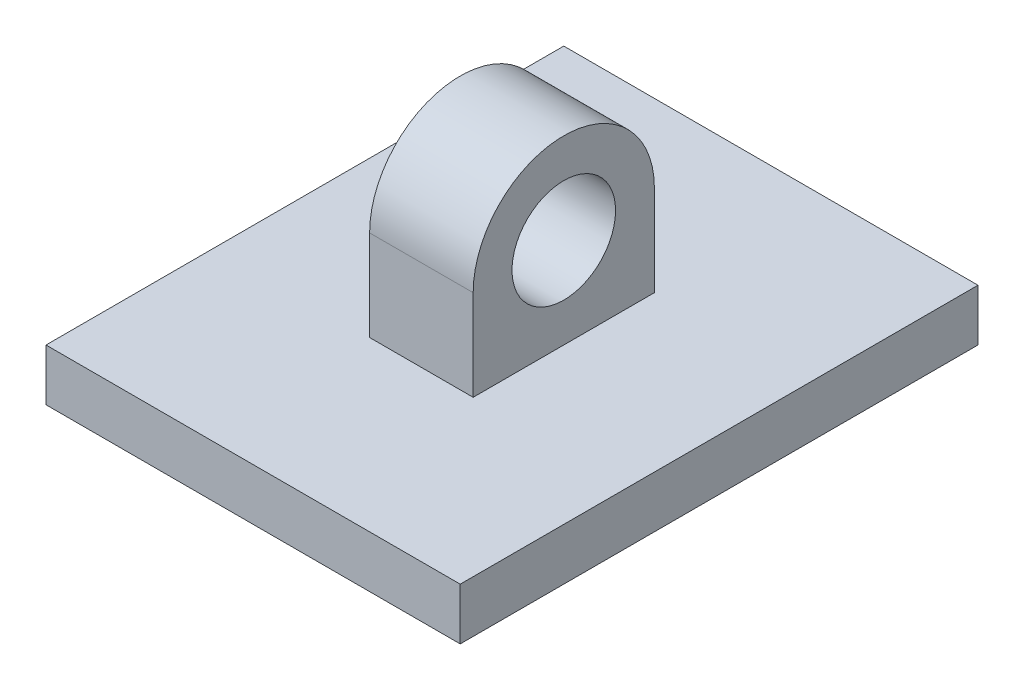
ISO-10303-21;
HEADER;
FILE_DESCRIPTION(('STEP AP214'),'2;1');
FILE_NAME('part.step','',(''),(''),'','','');
FILE_SCHEMA(('AUTOMOTIVE_DESIGN { 1 0 10303 214 1 1 1 1 }'));
ENDSEC;
DATA;
#1=APPLICATION_CONTEXT('core data for automotive mechanical design processes');
#2=APPLICATION_PROTOCOL_DEFINITION('international standard','automotive_design',2000,#1);
#3=PRODUCT_CONTEXT('',#1,'mechanical');
#4=PRODUCT('Part','Part','',(#3));
#5=PRODUCT_RELATED_PRODUCT_CATEGORY('part','',(#4));
#6=PRODUCT_DEFINITION_FORMATION('','',#4);
#7=PRODUCT_DEFINITION_CONTEXT('part definition',#1,'design');
#8=PRODUCT_DEFINITION('design','',#6,#7);
#9=PRODUCT_DEFINITION_SHAPE('','',#8);
#10=(LENGTH_UNIT() NAMED_UNIT(*) SI_UNIT(.MILLI.,.METRE.));
#11=(NAMED_UNIT(*) PLANE_ANGLE_UNIT() SI_UNIT($,.RADIAN.));
#12=(NAMED_UNIT(*) SI_UNIT($,.STERADIAN.) SOLID_ANGLE_UNIT());
#13=UNCERTAINTY_MEASURE_WITH_UNIT(LENGTH_MEASURE(1.E-05),#10,'distance_accuracy_value','');
#14=(GEOMETRIC_REPRESENTATION_CONTEXT(3) GLOBAL_UNCERTAINTY_ASSIGNED_CONTEXT((#13)) GLOBAL_UNIT_ASSIGNED_CONTEXT((#10,
#11,#12)) REPRESENTATION_CONTEXT('',''));
#15=CARTESIAN_POINT('',(0.,0.,0.));
#16=DIRECTION('',(0.,0.,1.));
#17=DIRECTION('',(1.,0.,0.));
#18=AXIS2_PLACEMENT_3D('',#15,#16,#17);
#19=CARTESIAN_POINT('',(50.,0.,-87.5));
#20=DIRECTION('',(0.,0.,-1.));
#21=DIRECTION('',(0.,1.,0.));
#22=AXIS2_PLACEMENT_3D('',#19,#20,#21);
#23=PLANE('',#22);
#24=DIRECTION('',(0.,-1.,0.));
#25=VECTOR('',#24,1.);
#26=CARTESIAN_POINT('',(-50.,0.,-87.5));
#27=LINE('',#26,#25);
#28=CARTESIAN_POINT('',(-50.,0.,-87.5));
#29=VERTEX_POINT('',#28);
#30=CARTESIAN_POINT('',(-50.,-87.5,-87.5));
#31=VERTEX_POINT('',#30);
#32=EDGE_CURVE('E168',#29,#31,#27,.T.);
#33=ORIENTED_EDGE('',*,*,#32,.F.);
#34=DIRECTION('',(-1.,0.,0.));
#35=VECTOR('',#34,1.);
#36=CARTESIAN_POINT('',(50.,0.,-87.5));
#37=LINE('',#36,#35);
#38=CARTESIAN_POINT('',(50.,0.,-87.5));
#39=VERTEX_POINT('',#38);
#40=EDGE_CURVE('E11',#39,#29,#37,.T.);
#41=ORIENTED_EDGE('',*,*,#40,.F.);
#42=DIRECTION('',(0.,-1.,0.));
#43=VECTOR('',#42,1.);
#44=CARTESIAN_POINT('',(50.,0.,-87.5));
#45=LINE('',#44,#43);
#46=CARTESIAN_POINT('',(50.,-87.5,-87.5));
#47=VERTEX_POINT('',#46);
#48=EDGE_CURVE('E157',#39,#47,#45,.T.);
#49=ORIENTED_EDGE('',*,*,#48,.T.);
#50=DIRECTION('',(-1.,0.,0.));
#51=VECTOR('',#50,1.);
#52=CARTESIAN_POINT('',(50.,-87.5,-87.5));
#53=LINE('',#52,#51);
#54=EDGE_CURVE('E77',#47,#31,#53,.T.);
#55=ORIENTED_EDGE('',*,*,#54,.T.);
#56=EDGE_LOOP('',(#33,#41,#49,#55));
#57=FACE_BOUND('',#56,.T.);
#58=ADVANCED_FACE('F39',(#57),#23,.T.);
#59=CARTESIAN_POINT('',(50.,0.,0.));
#60=DIRECTION('',(-1.,0.,0.));
#61=DIRECTION('',(0.,0.,1.));
#62=AXIS2_PLACEMENT_3D('',#59,#60,#61);
#63=CYLINDRICAL_SURFACE('',#62,87.5);
#64=CARTESIAN_POINT('',(-50.,0.,0.));
#65=DIRECTION('',(1.,0.,0.));
#66=DIRECTION('',(0.,0.,-1.));
#67=AXIS2_PLACEMENT_3D('',#64,#65,#66);
#68=CIRCLE('',#67,87.5);
#69=CARTESIAN_POINT('',(-50.,0.,87.5));
#70=VERTEX_POINT('',#69);
#71=EDGE_CURVE('E170',#29,#70,#68,.T.);
#72=ORIENTED_EDGE('',*,*,#71,.T.);
#73=DIRECTION('',(-1.,0.,0.));
#74=VECTOR('',#73,1.);
#75=CARTESIAN_POINT('',(50.,0.,87.5));
#76=LINE('',#75,#74);
#77=CARTESIAN_POINT('',(50.,0.,87.5));
#78=VERTEX_POINT('',#77);
#79=EDGE_CURVE('E48',#78,#70,#76,.T.);
#80=ORIENTED_EDGE('',*,*,#79,.F.);
#81=CARTESIAN_POINT('',(50.,0.,0.));
#82=DIRECTION('',(1.,0.,0.));
#83=DIRECTION('',(0.,0.,-1.));
#84=AXIS2_PLACEMENT_3D('',#81,#82,#83);
#85=CIRCLE('',#84,87.5);
#86=EDGE_CURVE('E160',#39,#78,#85,.T.);
#87=ORIENTED_EDGE('',*,*,#86,.F.);
#88=ORIENTED_EDGE('',*,*,#40,.T.);
#89=EDGE_LOOP('',(#72,#80,#87,#88));
#90=FACE_BOUND('',#89,.T.);
#91=ADVANCED_FACE('F184',(#90),#63,.T.);
#92=CARTESIAN_POINT('',(50.,0.,87.5));
#93=DIRECTION('',(0.,0.,-1.));
#94=DIRECTION('',(0.,1.,0.));
#95=AXIS2_PLACEMENT_3D('',#92,#93,#94);
#96=PLANE('',#95);
#97=DIRECTION('',(0.,-1.,0.));
#98=VECTOR('',#97,1.);
#99=CARTESIAN_POINT('',(-50.,0.,87.5));
#100=LINE('',#99,#98);
#101=CARTESIAN_POINT('',(-50.,-87.5,87.5));
#102=VERTEX_POINT('',#101);
#103=EDGE_CURVE('E70',#70,#102,#100,.T.);
#104=ORIENTED_EDGE('',*,*,#103,.T.);
#105=DIRECTION('',(-1.,0.,0.));
#106=VECTOR('',#105,1.);
#107=CARTESIAN_POINT('',(50.,-87.5,87.5));
#108=LINE('',#107,#106);
#109=CARTESIAN_POINT('',(50.,-87.5,87.5));
#110=VERTEX_POINT('',#109);
#111=EDGE_CURVE('E177',#110,#102,#108,.T.);
#112=ORIENTED_EDGE('',*,*,#111,.F.);
#113=DIRECTION('',(0.,-1.,0.));
#114=VECTOR('',#113,1.);
#115=CARTESIAN_POINT('',(50.,0.,87.5));
#116=LINE('',#115,#114);
#117=EDGE_CURVE('E163',#78,#110,#116,.T.);
#118=ORIENTED_EDGE('',*,*,#117,.F.);
#119=ORIENTED_EDGE('',*,*,#79,.T.);
#120=EDGE_LOOP('',(#104,#112,#118,#119));
#121=FACE_BOUND('',#120,.T.);
#122=ADVANCED_FACE('F181',(#121),#96,.F.);
#123=CARTESIAN_POINT('',(50.,0.,0.));
#124=DIRECTION('',(-1.,0.,0.));
#125=DIRECTION('',(0.,0.,1.));
#126=AXIS2_PLACEMENT_3D('',#123,#124,#125);
#127=CYLINDRICAL_SURFACE('',#126,50.);
#128=CARTESIAN_POINT('',(50.,0.,0.));
#129=DIRECTION('',(1.,0.,0.));
#130=DIRECTION('',(0.,0.,-1.));
#131=AXIS2_PLACEMENT_3D('',#128,#129,#130);
#132=CIRCLE('',#131,50.);
#133=CARTESIAN_POINT('',(50.,0.,-50.));
#134=VERTEX_POINT('',#133);
#135=EDGE_CURVE('E154',#134,#134,#132,.T.);
#136=ORIENTED_EDGE('',*,*,#135,.T.);
#137=EDGE_LOOP('',(#136));
#138=FACE_BOUND('',#137,.T.);
#139=CARTESIAN_POINT('',(-50.,0.,0.));
#140=DIRECTION('',(1.,0.,0.));
#141=DIRECTION('',(0.,0.,-1.));
#142=AXIS2_PLACEMENT_3D('',#139,#140,#141);
#143=CIRCLE('',#142,50.);
#144=CARTESIAN_POINT('',(-50.,0.,-50.));
#145=VERTEX_POINT('',#144);
#146=EDGE_CURVE('E122',#145,#145,#143,.T.);
#147=ORIENTED_EDGE('',*,*,#146,.F.);
#148=EDGE_LOOP('',(#147));
#149=FACE_BOUND('',#148,.T.);
#150=ADVANCED_FACE('F41',(#138,#149),#127,.F.);
#151=CARTESIAN_POINT('',(50.,0.,0.));
#152=DIRECTION('',(1.,0.,0.));
#153=DIRECTION('',(0.,0.,-1.));
#154=AXIS2_PLACEMENT_3D('',#151,#152,#153);
#155=PLANE('',#154);
#156=ORIENTED_EDGE('',*,*,#135,.F.);
#157=EDGE_LOOP('',(#156));
#158=FACE_BOUND('',#157,.T.);
#159=ORIENTED_EDGE('',*,*,#48,.F.);
#160=ORIENTED_EDGE('',*,*,#86,.T.);
#161=ORIENTED_EDGE('',*,*,#117,.T.);
#162=DIRECTION('',(0.,0.,-1.));
#163=VECTOR('',#162,1.);
#164=CARTESIAN_POINT('',(50.,-87.5,0.));
#165=LINE('',#164,#163);
#166=EDGE_CURVE('E56',#110,#47,#165,.T.);
#167=ORIENTED_EDGE('',*,*,#166,.T.);
#168=EDGE_LOOP('',(#159,#160,#161,#167));
#169=FACE_BOUND('',#168,.T.);
#170=ADVANCED_FACE('F196',(#158,#169),#155,.T.);
#171=CARTESIAN_POINT('',(-50.,0.,0.));
#172=DIRECTION('',(1.,0.,0.));
#173=DIRECTION('',(0.,0.,-1.));
#174=AXIS2_PLACEMENT_3D('',#171,#172,#173);
#175=PLANE('',#174);
#176=ORIENTED_EDGE('',*,*,#146,.T.);
#177=EDGE_LOOP('',(#176));
#178=FACE_BOUND('',#177,.T.);
#179=ORIENTED_EDGE('',*,*,#32,.T.);
#180=DIRECTION('',(0.,0.,-1.));
#181=VECTOR('',#180,1.);
#182=CARTESIAN_POINT('',(-50.,-87.5,0.));
#183=LINE('',#182,#181);
#184=EDGE_CURVE('E158',#102,#31,#183,.T.);
#185=ORIENTED_EDGE('',*,*,#184,.F.);
#186=ORIENTED_EDGE('',*,*,#103,.F.);
#187=ORIENTED_EDGE('',*,*,#71,.F.);
#188=EDGE_LOOP('',(#179,#185,#186,#187));
#189=FACE_BOUND('',#188,.T.);
#190=ADVANCED_FACE('F185',(#178,#189),#175,.F.);
#191=CARTESIAN_POINT('',(200.,-87.5,0.));
#192=DIRECTION('',(0.,1.,0.));
#193=DIRECTION('',(0.,0.,1.));
#194=AXIS2_PLACEMENT_3D('',#191,#192,#193);
#195=PLANE('',#194);
#196=ORIENTED_EDGE('',*,*,#111,.T.);
#197=ORIENTED_EDGE('',*,*,#184,.T.);
#198=ORIENTED_EDGE('',*,*,#54,.F.);
#199=ORIENTED_EDGE('',*,*,#166,.F.);
#200=EDGE_LOOP('',(#196,#197,#198,#199));
#201=FACE_BOUND('',#200,.T.);
#202=DIRECTION('',(0.,0.,-1.));
#203=VECTOR('',#202,1.);
#204=CARTESIAN_POINT('',(-200.,-87.5,0.));
#205=LINE('',#204,#203);
#206=CARTESIAN_POINT('',(-200.,-87.5,250.));
#207=VERTEX_POINT('',#206);
#208=CARTESIAN_POINT('',(-200.,-87.5,-250.));
#209=VERTEX_POINT('',#208);
#210=EDGE_CURVE('E117',#207,#209,#205,.T.);
#211=ORIENTED_EDGE('',*,*,#210,.F.);
#212=DIRECTION('',(-1.,0.,0.));
#213=VECTOR('',#212,1.);
#214=CARTESIAN_POINT('',(200.,-87.5,250.));
#215=LINE('',#214,#213);
#216=CARTESIAN_POINT('',(200.,-87.5,250.));
#217=VERTEX_POINT('',#216);
#218=EDGE_CURVE('E111',#217,#207,#215,.T.);
#219=ORIENTED_EDGE('',*,*,#218,.F.);
#220=DIRECTION('',(0.,0.,-1.));
#221=VECTOR('',#220,1.);
#222=CARTESIAN_POINT('',(200.,-87.5,0.));
#223=LINE('',#222,#221);
#224=CARTESIAN_POINT('',(200.,-87.5,-250.));
#225=VERTEX_POINT('',#224);
#226=EDGE_CURVE('E114',#217,#225,#223,.T.);
#227=ORIENTED_EDGE('',*,*,#226,.T.);
#228=DIRECTION('',(-1.,0.,0.));
#229=VECTOR('',#228,1.);
#230=CARTESIAN_POINT('',(200.,-87.5,-250.));
#231=LINE('',#230,#229);
#232=EDGE_CURVE('E141',#225,#209,#231,.T.);
#233=ORIENTED_EDGE('',*,*,#232,.T.);
#234=EDGE_LOOP('',(#211,#219,#227,#233));
#235=FACE_BOUND('',#234,.T.);
#236=ADVANCED_FACE('F113',(#201,#235),#195,.T.);
#237=CARTESIAN_POINT('',(200.,0.,250.));
#238=DIRECTION('',(0.,0.,1.));
#239=DIRECTION('',(1.,0.,0.));
#240=AXIS2_PLACEMENT_3D('',#237,#238,#239);
#241=PLANE('',#240);
#242=DIRECTION('',(0.,1.,0.));
#243=VECTOR('',#242,1.);
#244=CARTESIAN_POINT('',(-200.,0.,250.));
#245=LINE('',#244,#243);
#246=CARTESIAN_POINT('',(-200.,-137.5,250.));
#247=VERTEX_POINT('',#246);
#248=EDGE_CURVE('E143',#247,#207,#245,.T.);
#249=ORIENTED_EDGE('',*,*,#248,.F.);
#250=DIRECTION('',(-1.,0.,0.));
#251=VECTOR('',#250,1.);
#252=CARTESIAN_POINT('',(200.,-137.5,250.));
#253=LINE('',#252,#251);
#254=CARTESIAN_POINT('',(200.,-137.5,250.));
#255=VERTEX_POINT('',#254);
#256=EDGE_CURVE('E123',#255,#247,#253,.T.);
#257=ORIENTED_EDGE('',*,*,#256,.F.);
#258=DIRECTION('',(0.,1.,0.));
#259=VECTOR('',#258,1.);
#260=CARTESIAN_POINT('',(200.,0.,250.));
#261=LINE('',#260,#259);
#262=EDGE_CURVE('E129',#255,#217,#261,.T.);
#263=ORIENTED_EDGE('',*,*,#262,.T.);
#264=ORIENTED_EDGE('',*,*,#218,.T.);
#265=EDGE_LOOP('',(#249,#257,#263,#264));
#266=FACE_BOUND('',#265,.T.);
#267=ADVANCED_FACE('F135',(#266),#241,.T.);
#268=CARTESIAN_POINT('',(200.,-137.5,0.));
#269=DIRECTION('',(0.,-1.,0.));
#270=DIRECTION('',(0.,0.,-1.));
#271=AXIS2_PLACEMENT_3D('',#268,#269,#270);
#272=PLANE('',#271);
#273=DIRECTION('',(0.,0.,1.));
#274=VECTOR('',#273,1.);
#275=CARTESIAN_POINT('',(-200.,-137.5,0.));
#276=LINE('',#275,#274);
#277=CARTESIAN_POINT('',(-200.,-137.5,-250.));
#278=VERTEX_POINT('',#277);
#279=EDGE_CURVE('E145',#278,#247,#276,.T.);
#280=ORIENTED_EDGE('',*,*,#279,.F.);
#281=DIRECTION('',(-1.,0.,0.));
#282=VECTOR('',#281,1.);
#283=CARTESIAN_POINT('',(200.,-137.5,-250.));
#284=LINE('',#283,#282);
#285=CARTESIAN_POINT('',(200.,-137.5,-250.));
#286=VERTEX_POINT('',#285);
#287=EDGE_CURVE('E151',#286,#278,#284,.T.);
#288=ORIENTED_EDGE('',*,*,#287,.F.);
#289=DIRECTION('',(0.,0.,1.));
#290=VECTOR('',#289,1.);
#291=CARTESIAN_POINT('',(200.,-137.5,0.));
#292=LINE('',#291,#290);
#293=EDGE_CURVE('E136',#286,#255,#292,.T.);
#294=ORIENTED_EDGE('',*,*,#293,.T.);
#295=ORIENTED_EDGE('',*,*,#256,.T.);
#296=EDGE_LOOP('',(#280,#288,#294,#295));
#297=FACE_BOUND('',#296,.T.);
#298=ADVANCED_FACE('F206',(#297),#272,.T.);
#299=CARTESIAN_POINT('',(200.,0.,-250.));
#300=DIRECTION('',(0.,0.,-1.));
#301=DIRECTION('',(-1.,0.,0.));
#302=AXIS2_PLACEMENT_3D('',#299,#300,#301);
#303=PLANE('',#302);
#304=DIRECTION('',(0.,-1.,0.));
#305=VECTOR('',#304,1.);
#306=CARTESIAN_POINT('',(-200.,0.,-250.));
#307=LINE('',#306,#305);
#308=EDGE_CURVE('E133',#209,#278,#307,.T.);
#309=ORIENTED_EDGE('',*,*,#308,.F.);
#310=ORIENTED_EDGE('',*,*,#232,.F.);
#311=DIRECTION('',(0.,-1.,0.));
#312=VECTOR('',#311,1.);
#313=CARTESIAN_POINT('',(200.,0.,-250.));
#314=LINE('',#313,#312);
#315=EDGE_CURVE('E132',#225,#286,#314,.T.);
#316=ORIENTED_EDGE('',*,*,#315,.T.);
#317=ORIENTED_EDGE('',*,*,#287,.T.);
#318=EDGE_LOOP('',(#309,#310,#316,#317));
#319=FACE_BOUND('',#318,.T.);
#320=ADVANCED_FACE('F209',(#319),#303,.T.);
#321=CARTESIAN_POINT('',(200.,0.,0.));
#322=DIRECTION('',(1.,0.,0.));
#323=DIRECTION('',(0.,0.,-1.));
#324=AXIS2_PLACEMENT_3D('',#321,#322,#323);
#325=PLANE('',#324);
#326=ORIENTED_EDGE('',*,*,#226,.F.);
#327=ORIENTED_EDGE('',*,*,#262,.F.);
#328=ORIENTED_EDGE('',*,*,#293,.F.);
#329=ORIENTED_EDGE('',*,*,#315,.F.);
#330=EDGE_LOOP('',(#326,#327,#328,#329));
#331=FACE_BOUND('',#330,.T.);
#332=ADVANCED_FACE('F127',(#331),#325,.T.);
#333=CARTESIAN_POINT('',(-200.,0.,0.));
#334=DIRECTION('',(1.,0.,0.));
#335=DIRECTION('',(0.,0.,-1.));
#336=AXIS2_PLACEMENT_3D('',#333,#334,#335);
#337=PLANE('',#336);
#338=ORIENTED_EDGE('',*,*,#210,.T.);
#339=ORIENTED_EDGE('',*,*,#308,.T.);
#340=ORIENTED_EDGE('',*,*,#279,.T.);
#341=ORIENTED_EDGE('',*,*,#248,.T.);
#342=EDGE_LOOP('',(#338,#339,#340,#341));
#343=FACE_BOUND('',#342,.T.);
#344=ADVANCED_FACE('F214',(#343),#337,.F.);
#345=CLOSED_SHELL('',(#58,#91,#122,#150,#170,#190,#236,#267,#298,#320,#332,#344));
#346=MANIFOLD_SOLID_BREP('B2',#345);
#347=ADVANCED_BREP_SHAPE_REPRESENTATION('',(#18,#346),#14);
#348=SHAPE_DEFINITION_REPRESENTATION(#9,#347);
ENDSEC;
END-ISO-10303-21;
